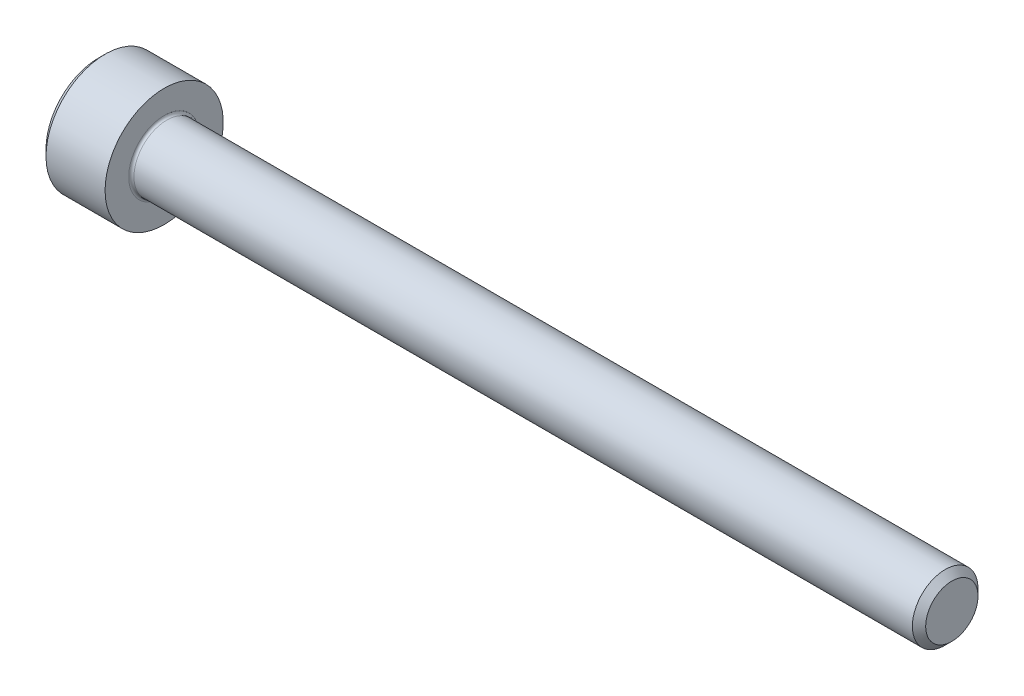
ISO-10303-21;
HEADER;
FILE_DESCRIPTION(('STEP AP214'),'2;1');
FILE_NAME('part.step','',(''),(''),'','','');
FILE_SCHEMA(('AUTOMOTIVE_DESIGN { 1 0 10303 214 1 1 1 1 }'));
ENDSEC;
DATA;
#1=APPLICATION_CONTEXT('core data for automotive mechanical design processes');
#2=APPLICATION_PROTOCOL_DEFINITION('international standard','automotive_design',2000,#1);
#3=PRODUCT_CONTEXT('',#1,'mechanical');
#4=PRODUCT('Part','Part','',(#3));
#5=PRODUCT_RELATED_PRODUCT_CATEGORY('part','',(#4));
#6=PRODUCT_DEFINITION_FORMATION('','',#4);
#7=PRODUCT_DEFINITION_CONTEXT('part definition',#1,'design');
#8=PRODUCT_DEFINITION('design','',#6,#7);
#9=PRODUCT_DEFINITION_SHAPE('','',#8);
#10=(LENGTH_UNIT() NAMED_UNIT(*) SI_UNIT(.MILLI.,.METRE.));
#11=(NAMED_UNIT(*) PLANE_ANGLE_UNIT() SI_UNIT($,.RADIAN.));
#12=(NAMED_UNIT(*) SI_UNIT($,.STERADIAN.) SOLID_ANGLE_UNIT());
#13=UNCERTAINTY_MEASURE_WITH_UNIT(LENGTH_MEASURE(1.E-05),#10,'distance_accuracy_value','');
#14=(GEOMETRIC_REPRESENTATION_CONTEXT(3) GLOBAL_UNCERTAINTY_ASSIGNED_CONTEXT((#13)) GLOBAL_UNIT_ASSIGNED_CONTEXT((#10,
#11,#12)) REPRESENTATION_CONTEXT('',''));
#15=CARTESIAN_POINT('',(0.,0.,0.));
#16=DIRECTION('',(0.,0.,1.));
#17=DIRECTION('',(1.,0.,0.));
#18=AXIS2_PLACEMENT_3D('',#15,#16,#17);
#19=CARTESIAN_POINT('',(0.,0.,0.));
#20=DIRECTION('',(-1.,0.,0.));
#21=DIRECTION('',(0.,0.,1.));
#22=AXIS2_PLACEMENT_3D('',#19,#20,#21);
#23=PLANE('',#22);
#24=DIRECTION('',(0.,-0.499999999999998,0.866025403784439));
#25=VECTOR('',#24,1.);
#26=CARTESIAN_POINT('',(0.,1.18068130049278,0.));
#27=LINE('',#26,#25);
#28=CARTESIAN_POINT('',(0.,1.18068130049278,0.));
#29=VERTEX_POINT('',#28);
#30=CARTESIAN_POINT('',(0.,0.590340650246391,1.0225));
#31=VERTEX_POINT('',#30);
#32=EDGE_CURVE('E370',#29,#31,#27,.T.);
#33=ORIENTED_EDGE('',*,*,#32,.T.);
#34=DIRECTION('',(0.,1.,0.));
#35=VECTOR('',#34,1.);
#36=CARTESIAN_POINT('',(0.,-0.590340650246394,1.0225));
#37=LINE('',#36,#35);
#38=CARTESIAN_POINT('',(0.,-0.590340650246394,1.0225));
#39=VERTEX_POINT('',#38);
#40=EDGE_CURVE('E126',#39,#31,#37,.T.);
#41=ORIENTED_EDGE('',*,*,#40,.F.);
#42=DIRECTION('',(0.,-0.500000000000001,-0.866025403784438));
#43=VECTOR('',#42,1.);
#44=CARTESIAN_POINT('',(0.,-0.590340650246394,1.0225));
#45=LINE('',#44,#43);
#46=CARTESIAN_POINT('',(0.,-1.18068130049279,0.));
#47=VERTEX_POINT('',#46);
#48=EDGE_CURVE('E373',#39,#47,#45,.T.);
#49=ORIENTED_EDGE('',*,*,#48,.T.);
#50=DIRECTION('',(0.,0.499999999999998,-0.86602540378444));
#51=VECTOR('',#50,1.);
#52=CARTESIAN_POINT('',(0.,-1.18068130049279,0.));
#53=LINE('',#52,#51);
#54=CARTESIAN_POINT('',(0.,-0.590340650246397,-1.0225));
#55=VERTEX_POINT('',#54);
#56=EDGE_CURVE('E376',#47,#55,#53,.T.);
#57=ORIENTED_EDGE('',*,*,#56,.T.);
#58=DIRECTION('',(0.,-1.,0.));
#59=VECTOR('',#58,1.);
#60=CARTESIAN_POINT('',(0.,0.590340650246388,-1.0225));
#61=LINE('',#60,#59);
#62=CARTESIAN_POINT('',(0.,0.590340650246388,-1.0225));
#63=VERTEX_POINT('',#62);
#64=EDGE_CURVE('E379',#63,#55,#61,.T.);
#65=ORIENTED_EDGE('',*,*,#64,.F.);
#66=DIRECTION('',(0.,-0.500000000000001,-0.866025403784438));
#67=VECTOR('',#66,1.);
#68=CARTESIAN_POINT('',(0.,1.18068130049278,0.));
#69=LINE('',#68,#67);
#70=EDGE_CURVE('E121',#29,#63,#69,.T.);
#71=ORIENTED_EDGE('',*,*,#70,.F.);
#72=EDGE_LOOP('',(#33,#41,#49,#57,#65,#71));
#73=FACE_BOUND('',#72,.T.);
#74=CARTESIAN_POINT('',(0.,0.,0.));
#75=DIRECTION('',(-1.,0.,0.));
#76=DIRECTION('',(0.,0.,1.));
#77=AXIS2_PLACEMENT_3D('',#74,#75,#76);
#78=CIRCLE('',#77,2.);
#79=CARTESIAN_POINT('',(0.,0.,2.));
#80=VERTEX_POINT('',#79);
#81=EDGE_CURVE('E137',#80,#80,#78,.T.);
#82=ORIENTED_EDGE('',*,*,#81,.T.);
#83=EDGE_LOOP('',(#82));
#84=FACE_BOUND('',#83,.T.);
#85=ADVANCED_FACE('F30',(#73,#84),#23,.T.);
#86=CARTESIAN_POINT('',(32.5,0.9965,0.));
#87=DIRECTION('',(1.,0.,0.));
#88=DIRECTION('',(0.,0.,-1.));
#89=AXIS2_PLACEMENT_3D('',#86,#87,#88);
#90=PLANE('',#89);
#91=CARTESIAN_POINT('',(32.5,0.,0.));
#92=DIRECTION('',(-1.,0.,0.));
#93=DIRECTION('',(0.,0.,1.));
#94=AXIS2_PLACEMENT_3D('',#91,#92,#93);
#95=CIRCLE('',#94,0.9965);
#96=CARTESIAN_POINT('',(32.5,0.,0.9965));
#97=VERTEX_POINT('',#96);
#98=EDGE_CURVE('E150',#97,#97,#95,.T.);
#99=ORIENTED_EDGE('',*,*,#98,.F.);
#100=EDGE_LOOP('',(#99));
#101=FACE_BOUND('',#100,.T.);
#102=ADVANCED_FACE('F171',(#101),#90,.T.);
#103=CARTESIAN_POINT('',(32.5,0.,0.));
#104=DIRECTION('',(-1.,0.,0.));
#105=DIRECTION('',(0.,0.,1.));
#106=AXIS2_PLACEMENT_3D('',#103,#104,#105);
#107=CONICAL_SURFACE('',#106,0.9965,0.785398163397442);
#108=CARTESIAN_POINT('',(32.2465,0.,0.));
#109=DIRECTION('',(-1.,0.,0.));
#110=DIRECTION('',(0.,0.,1.));
#111=AXIS2_PLACEMENT_3D('',#108,#109,#110);
#112=CIRCLE('',#111,1.25);
#113=CARTESIAN_POINT('',(32.2465,0.,1.25));
#114=VERTEX_POINT('',#113);
#115=EDGE_CURVE('E147',#114,#114,#112,.T.);
#116=ORIENTED_EDGE('',*,*,#115,.F.);
#117=EDGE_LOOP('',(#116));
#118=FACE_BOUND('',#117,.T.);
#119=ORIENTED_EDGE('',*,*,#98,.T.);
#120=EDGE_LOOP('',(#119));
#121=FACE_BOUND('',#120,.T.);
#122=ADVANCED_FACE('F177',(#118,#121),#107,.T.);
#123=CARTESIAN_POINT('',(-31.75,0.,0.));
#124=DIRECTION('',(-1.,0.,0.));
#125=DIRECTION('',(0.,0.,1.));
#126=AXIS2_PLACEMENT_3D('',#123,#124,#125);
#127=CYLINDRICAL_SURFACE('',#126,1.25);
#128=CARTESIAN_POINT('',(2.6,0.,0.));
#129=DIRECTION('',(1.,0.,0.));
#130=DIRECTION('',(0.,0.,-1.));
#131=AXIS2_PLACEMENT_3D('',#128,#129,#130);
#132=CIRCLE('',#131,1.25);
#133=CARTESIAN_POINT('',(2.6,0.,-1.25));
#134=VERTEX_POINT('',#133);
#135=EDGE_CURVE('E11',#134,#134,#132,.T.);
#136=ORIENTED_EDGE('',*,*,#135,.T.);
#137=EDGE_LOOP('',(#136));
#138=FACE_BOUND('',#137,.T.);
#139=ORIENTED_EDGE('',*,*,#115,.T.);
#140=EDGE_LOOP('',(#139));
#141=FACE_BOUND('',#140,.T.);
#142=ADVANCED_FACE('F188',(#138,#141),#127,.T.);
#143=CARTESIAN_POINT('',(2.5,2.25,0.));
#144=DIRECTION('',(1.,0.,0.));
#145=DIRECTION('',(0.,0.,-1.));
#146=AXIS2_PLACEMENT_3D('',#143,#144,#145);
#147=PLANE('',#146);
#148=CARTESIAN_POINT('',(2.5,0.,0.));
#149=DIRECTION('',(1.,0.,0.));
#150=DIRECTION('',(0.,0.,-1.));
#151=AXIS2_PLACEMENT_3D('',#148,#149,#150);
#152=CIRCLE('',#151,1.35);
#153=CARTESIAN_POINT('',(2.5,0.,-1.35));
#154=VERTEX_POINT('',#153);
#155=EDGE_CURVE('E38',#154,#154,#152,.F.);
#156=ORIENTED_EDGE('',*,*,#155,.T.);
#157=EDGE_LOOP('',(#156));
#158=FACE_BOUND('',#157,.T.);
#159=CARTESIAN_POINT('',(2.5,0.,0.));
#160=DIRECTION('',(-1.,0.,0.));
#161=DIRECTION('',(0.,0.,1.));
#162=AXIS2_PLACEMENT_3D('',#159,#160,#161);
#163=CIRCLE('',#162,2.25);
#164=CARTESIAN_POINT('',(2.5,0.,2.25));
#165=VERTEX_POINT('',#164);
#166=EDGE_CURVE('E144',#165,#165,#163,.T.);
#167=ORIENTED_EDGE('',*,*,#166,.F.);
#168=EDGE_LOOP('',(#167));
#169=FACE_BOUND('',#168,.T.);
#170=ADVANCED_FACE('F155',(#158,#169),#147,.T.);
#171=CARTESIAN_POINT('',(-31.75,0.,0.));
#172=DIRECTION('',(-1.,0.,0.));
#173=DIRECTION('',(0.,0.,1.));
#174=AXIS2_PLACEMENT_3D('',#171,#172,#173);
#175=CYLINDRICAL_SURFACE('',#174,2.25);
#176=ORIENTED_EDGE('',*,*,#166,.T.);
#177=EDGE_LOOP('',(#176));
#178=FACE_BOUND('',#177,.T.);
#179=CARTESIAN_POINT('',(0.25,0.,0.));
#180=DIRECTION('',(-1.,0.,0.));
#181=DIRECTION('',(0.,0.,1.));
#182=AXIS2_PLACEMENT_3D('',#179,#180,#181);
#183=CIRCLE('',#182,2.25);
#184=CARTESIAN_POINT('',(0.25,0.,2.25));
#185=VERTEX_POINT('',#184);
#186=EDGE_CURVE('E141',#185,#185,#183,.T.);
#187=ORIENTED_EDGE('',*,*,#186,.F.);
#188=EDGE_LOOP('',(#187));
#189=FACE_BOUND('',#188,.T.);
#190=ADVANCED_FACE('F166',(#178,#189),#175,.T.);
#191=CARTESIAN_POINT('',(0.,0.,0.));
#192=DIRECTION('',(1.,0.,0.));
#193=DIRECTION('',(0.,0.,-1.));
#194=AXIS2_PLACEMENT_3D('',#191,#192,#193);
#195=CONICAL_SURFACE('',#194,2.,0.785398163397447);
#196=ORIENTED_EDGE('',*,*,#186,.T.);
#197=EDGE_LOOP('',(#196));
#198=FACE_BOUND('',#197,.T.);
#199=ORIENTED_EDGE('',*,*,#81,.F.);
#200=EDGE_LOOP('',(#199));
#201=FACE_BOUND('',#200,.T.);
#202=ADVANCED_FACE('F159',(#198,#201),#195,.T.);
#203=CARTESIAN_POINT('',(2.6,0.,0.));
#204=DIRECTION('',(1.,0.,0.));
#205=DIRECTION('',(0.,0.,-1.));
#206=AXIS2_PLACEMENT_3D('',#203,#204,#205);
#207=TOROIDAL_SURFACE('',#206,1.35,0.1);
#208=ORIENTED_EDGE('',*,*,#135,.F.);
#209=EDGE_LOOP('',(#208));
#210=FACE_BOUND('',#209,.T.);
#211=ORIENTED_EDGE('',*,*,#155,.F.);
#212=EDGE_LOOP('',(#211));
#213=FACE_BOUND('',#212,.T.);
#214=ADVANCED_FACE('F32',(#210,#213),#207,.F.);
#215=CARTESIAN_POINT('',(1.1,1.18068130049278,0.));
#216=DIRECTION('',(0.,-0.86602540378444,-0.499999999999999));
#217=DIRECTION('',(0.,0.499999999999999,-0.86602540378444));
#218=AXIS2_PLACEMENT_3D('',#215,#216,#217);
#219=PLANE('',#218);
#220=ORIENTED_EDGE('',*,*,#32,.F.);
#221=DIRECTION('',(-1.,0.,0.));
#222=VECTOR('',#221,1.);
#223=CARTESIAN_POINT('',(1.1,1.18068130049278,0.));
#224=LINE('',#223,#222);
#225=CARTESIAN_POINT('',(1.1,1.18068130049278,0.));
#226=VERTEX_POINT('',#225);
#227=EDGE_CURVE('E360',#226,#29,#224,.T.);
#228=ORIENTED_EDGE('',*,*,#227,.F.);
#229=DIRECTION('',(0.,-0.499999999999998,0.866025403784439));
#230=VECTOR('',#229,1.);
#231=CARTESIAN_POINT('',(1.1,1.18068130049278,0.));
#232=LINE('',#231,#230);
#233=CARTESIAN_POINT('',(1.1,0.885510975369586,0.511249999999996));
#234=VERTEX_POINT('',#233);
#235=EDGE_CURVE('E113',#226,#234,#232,.T.);
#236=ORIENTED_EDGE('',*,*,#235,.T.);
#237=CARTESIAN_POINT('',(1.1,0.590340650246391,1.0225));
#238=VERTEX_POINT('',#237);
#239=EDGE_CURVE('E104',#234,#238,#232,.T.);
#240=ORIENTED_EDGE('',*,*,#239,.T.);
#241=DIRECTION('',(-1.,0.,0.));
#242=VECTOR('',#241,1.);
#243=CARTESIAN_POINT('',(1.1,0.590340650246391,1.0225));
#244=LINE('',#243,#242);
#245=EDGE_CURVE('E118',#238,#31,#244,.T.);
#246=ORIENTED_EDGE('',*,*,#245,.T.);
#247=EDGE_LOOP('',(#220,#228,#236,#240,#246));
#248=FACE_BOUND('',#247,.T.);
#249=ADVANCED_FACE('F117',(#248),#219,.T.);
#250=CARTESIAN_POINT('',(1.1,-0.590340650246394,1.0225));
#251=DIRECTION('',(0.,0.,1.));
#252=DIRECTION('',(0.,-1.,0.));
#253=AXIS2_PLACEMENT_3D('',#250,#251,#252);
#254=PLANE('',#253);
#255=ORIENTED_EDGE('',*,*,#40,.T.);
#256=ORIENTED_EDGE('',*,*,#245,.F.);
#257=DIRECTION('',(0.,1.,0.));
#258=VECTOR('',#257,1.);
#259=CARTESIAN_POINT('',(1.1,-0.590340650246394,1.0225));
#260=LINE('',#259,#258);
#261=CARTESIAN_POINT('',(1.1,0.,1.0225));
#262=VERTEX_POINT('',#261);
#263=EDGE_CURVE('E101',#262,#238,#260,.T.);
#264=ORIENTED_EDGE('',*,*,#263,.F.);
#265=CARTESIAN_POINT('',(1.1,-0.590340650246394,1.0225));
#266=VERTEX_POINT('',#265);
#267=EDGE_CURVE('E112',#266,#262,#260,.T.);
#268=ORIENTED_EDGE('',*,*,#267,.F.);
#269=DIRECTION('',(-1.,0.,0.));
#270=VECTOR('',#269,1.);
#271=CARTESIAN_POINT('',(1.1,-0.590340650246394,1.0225));
#272=LINE('',#271,#270);
#273=EDGE_CURVE('E128',#266,#39,#272,.T.);
#274=ORIENTED_EDGE('',*,*,#273,.T.);
#275=EDGE_LOOP('',(#255,#256,#264,#268,#274));
#276=FACE_BOUND('',#275,.T.);
#277=ADVANCED_FACE('F123',(#276),#254,.F.);
#278=CARTESIAN_POINT('',(1.1,-0.590340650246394,1.0225));
#279=DIRECTION('',(0.,0.866025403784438,-0.500000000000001));
#280=DIRECTION('',(0.,0.500000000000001,0.866025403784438));
#281=AXIS2_PLACEMENT_3D('',#278,#279,#280);
#282=PLANE('',#281);
#283=ORIENTED_EDGE('',*,*,#48,.F.);
#284=ORIENTED_EDGE('',*,*,#273,.F.);
#285=DIRECTION('',(0.,-0.500000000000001,-0.866025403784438));
#286=VECTOR('',#285,1.);
#287=CARTESIAN_POINT('',(1.1,-0.590340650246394,1.0225));
#288=LINE('',#287,#286);
#289=CARTESIAN_POINT('',(1.1,-0.885510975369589,0.511250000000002));
#290=VERTEX_POINT('',#289);
#291=EDGE_CURVE('E399',#266,#290,#288,.T.);
#292=ORIENTED_EDGE('',*,*,#291,.T.);
#293=CARTESIAN_POINT('',(1.1,-1.18068130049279,0.));
#294=VERTEX_POINT('',#293);
#295=EDGE_CURVE('E388',#290,#294,#288,.T.);
#296=ORIENTED_EDGE('',*,*,#295,.T.);
#297=DIRECTION('',(-1.,0.,0.));
#298=VECTOR('',#297,1.);
#299=CARTESIAN_POINT('',(1.1,-1.18068130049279,0.));
#300=LINE('',#299,#298);
#301=EDGE_CURVE('E133',#294,#47,#300,.T.);
#302=ORIENTED_EDGE('',*,*,#301,.T.);
#303=EDGE_LOOP('',(#283,#284,#292,#296,#302));
#304=FACE_BOUND('',#303,.T.);
#305=ADVANCED_FACE('F251',(#304),#282,.T.);
#306=CARTESIAN_POINT('',(1.1,-1.18068130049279,0.));
#307=DIRECTION('',(0.,0.86602540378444,0.499999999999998));
#308=DIRECTION('',(0.,-0.499999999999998,0.86602540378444));
#309=AXIS2_PLACEMENT_3D('',#306,#307,#308);
#310=PLANE('',#309);
#311=ORIENTED_EDGE('',*,*,#56,.F.);
#312=ORIENTED_EDGE('',*,*,#301,.F.);
#313=DIRECTION('',(0.,0.499999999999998,-0.86602540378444));
#314=VECTOR('',#313,1.);
#315=CARTESIAN_POINT('',(1.1,-1.18068130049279,0.));
#316=LINE('',#315,#314);
#317=CARTESIAN_POINT('',(1.1,-0.885510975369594,-0.51125));
#318=VERTEX_POINT('',#317);
#319=EDGE_CURVE('E366',#294,#318,#316,.T.);
#320=ORIENTED_EDGE('',*,*,#319,.T.);
#321=CARTESIAN_POINT('',(1.1,-0.590340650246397,-1.0225));
#322=VERTEX_POINT('',#321);
#323=EDGE_CURVE('E398',#318,#322,#316,.T.);
#324=ORIENTED_EDGE('',*,*,#323,.T.);
#325=DIRECTION('',(-1.,0.,0.));
#326=VECTOR('',#325,1.);
#327=CARTESIAN_POINT('',(1.1,-0.590340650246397,-1.0225));
#328=LINE('',#327,#326);
#329=EDGE_CURVE('E359',#322,#55,#328,.T.);
#330=ORIENTED_EDGE('',*,*,#329,.T.);
#331=EDGE_LOOP('',(#311,#312,#320,#324,#330));
#332=FACE_BOUND('',#331,.T.);
#333=ADVANCED_FACE('F259',(#332),#310,.T.);
#334=CARTESIAN_POINT('',(1.1,0.590340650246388,-1.0225));
#335=DIRECTION('',(0.,0.,-1.));
#336=DIRECTION('',(0.,1.,0.));
#337=AXIS2_PLACEMENT_3D('',#334,#335,#336);
#338=PLANE('',#337);
#339=ORIENTED_EDGE('',*,*,#64,.T.);
#340=ORIENTED_EDGE('',*,*,#329,.F.);
#341=DIRECTION('',(0.,-1.,0.));
#342=VECTOR('',#341,1.);
#343=CARTESIAN_POINT('',(1.1,0.590340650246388,-1.0225));
#344=LINE('',#343,#342);
#345=CARTESIAN_POINT('',(1.1,0.,-1.0225));
#346=VERTEX_POINT('',#345);
#347=EDGE_CURVE('E363',#346,#322,#344,.T.);
#348=ORIENTED_EDGE('',*,*,#347,.F.);
#349=CARTESIAN_POINT('',(1.1,0.590340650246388,-1.0225));
#350=VERTEX_POINT('',#349);
#351=EDGE_CURVE('E45',#350,#346,#344,.T.);
#352=ORIENTED_EDGE('',*,*,#351,.F.);
#353=DIRECTION('',(-1.,0.,0.));
#354=VECTOR('',#353,1.);
#355=CARTESIAN_POINT('',(1.1,0.590340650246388,-1.0225));
#356=LINE('',#355,#354);
#357=EDGE_CURVE('E356',#350,#63,#356,.T.);
#358=ORIENTED_EDGE('',*,*,#357,.T.);
#359=EDGE_LOOP('',(#339,#340,#348,#352,#358));
#360=FACE_BOUND('',#359,.T.);
#361=ADVANCED_FACE('F268',(#360),#338,.F.);
#362=CARTESIAN_POINT('',(1.1,1.18068130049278,0.));
#363=DIRECTION('',(0.,0.866025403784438,-0.500000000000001));
#364=DIRECTION('',(0.,0.500000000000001,0.866025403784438));
#365=AXIS2_PLACEMENT_3D('',#362,#363,#364);
#366=PLANE('',#365);
#367=ORIENTED_EDGE('',*,*,#70,.T.);
#368=ORIENTED_EDGE('',*,*,#357,.F.);
#369=DIRECTION('',(0.,-0.500000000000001,-0.866025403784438));
#370=VECTOR('',#369,1.);
#371=CARTESIAN_POINT('',(1.1,1.18068130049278,0.));
#372=LINE('',#371,#370);
#373=CARTESIAN_POINT('',(1.1,0.885510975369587,-0.511250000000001));
#374=VERTEX_POINT('',#373);
#375=EDGE_CURVE('E346',#374,#350,#372,.T.);
#376=ORIENTED_EDGE('',*,*,#375,.F.);
#377=EDGE_CURVE('E352',#226,#374,#372,.T.);
#378=ORIENTED_EDGE('',*,*,#377,.F.);
#379=ORIENTED_EDGE('',*,*,#227,.T.);
#380=EDGE_LOOP('',(#367,#368,#376,#378,#379));
#381=FACE_BOUND('',#380,.T.);
#382=ADVANCED_FACE('F277',(#381),#366,.F.);
#383=CARTESIAN_POINT('',(1.1,1.77102195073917,-1.0225));
#384=DIRECTION('',(1.,0.,0.));
#385=DIRECTION('',(0.,0.,-1.));
#386=AXIS2_PLACEMENT_3D('',#383,#384,#385);
#387=PLANE('',#386);
#388=ORIENTED_EDGE('',*,*,#347,.T.);
#389=ORIENTED_EDGE('',*,*,#323,.F.);
#390=CARTESIAN_POINT('',(1.1,0.,0.));
#391=DIRECTION('',(-1.,0.,0.));
#392=DIRECTION('',(0.,0.,1.));
#393=AXIS2_PLACEMENT_3D('',#390,#391,#392);
#394=CIRCLE('',#393,1.0225);
#395=EDGE_CURVE('E394',#346,#318,#394,.T.);
#396=ORIENTED_EDGE('',*,*,#395,.F.);
#397=EDGE_LOOP('',(#388,#389,#396));
#398=FACE_BOUND('',#397,.T.);
#399=ADVANCED_FACE('F286',(#398),#387,.F.);
#400=ORIENTED_EDGE('',*,*,#319,.F.);
#401=ORIENTED_EDGE('',*,*,#295,.F.);
#402=EDGE_CURVE('E131',#318,#290,#394,.T.);
#403=ORIENTED_EDGE('',*,*,#402,.F.);
#404=EDGE_LOOP('',(#400,#401,#403));
#405=FACE_BOUND('',#404,.T.);
#406=ADVANCED_FACE('F295',(#405),#387,.F.);
#407=ORIENTED_EDGE('',*,*,#291,.F.);
#408=ORIENTED_EDGE('',*,*,#267,.T.);
#409=EDGE_CURVE('E127',#290,#262,#394,.T.);
#410=ORIENTED_EDGE('',*,*,#409,.F.);
#411=EDGE_LOOP('',(#407,#408,#410));
#412=FACE_BOUND('',#411,.T.);
#413=ADVANCED_FACE('F304',(#412),#387,.F.);
#414=ORIENTED_EDGE('',*,*,#263,.T.);
#415=ORIENTED_EDGE('',*,*,#239,.F.);
#416=EDGE_CURVE('E107',#262,#234,#394,.T.);
#417=ORIENTED_EDGE('',*,*,#416,.F.);
#418=EDGE_LOOP('',(#414,#415,#417));
#419=FACE_BOUND('',#418,.T.);
#420=ADVANCED_FACE('F103',(#419),#387,.F.);
#421=ORIENTED_EDGE('',*,*,#235,.F.);
#422=ORIENTED_EDGE('',*,*,#377,.T.);
#423=EDGE_CURVE('E138',#234,#374,#394,.T.);
#424=ORIENTED_EDGE('',*,*,#423,.F.);
#425=EDGE_LOOP('',(#421,#422,#424));
#426=FACE_BOUND('',#425,.T.);
#427=ADVANCED_FACE('F319',(#426),#387,.F.);
#428=ORIENTED_EDGE('',*,*,#375,.T.);
#429=ORIENTED_EDGE('',*,*,#351,.T.);
#430=EDGE_CURVE('E349',#374,#346,#394,.T.);
#431=ORIENTED_EDGE('',*,*,#430,.F.);
#432=EDGE_LOOP('',(#428,#429,#431));
#433=FACE_BOUND('',#432,.T.);
#434=ADVANCED_FACE('F234',(#433),#387,.F.);
#435=CARTESIAN_POINT('',(1.1,0.,0.));
#436=DIRECTION('',(-1.,0.,0.));
#437=DIRECTION('',(0.,0.,1.));
#438=AXIS2_PLACEMENT_3D('',#435,#436,#437);
#439=CONICAL_SURFACE('',#438,1.0225,1.04719755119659);
#440=CARTESIAN_POINT('',(1.6903406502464,0.,0.));
#441=VERTEX_POINT('',#440);
#442=VERTEX_LOOP('',#441);
#443=FACE_BOUND('',#442,.T.);
#444=ORIENTED_EDGE('',*,*,#416,.T.);
#445=ORIENTED_EDGE('',*,*,#423,.T.);
#446=ORIENTED_EDGE('',*,*,#430,.T.);
#447=ORIENTED_EDGE('',*,*,#395,.T.);
#448=ORIENTED_EDGE('',*,*,#402,.T.);
#449=ORIENTED_EDGE('',*,*,#409,.T.);
#450=EDGE_LOOP('',(#444,#445,#446,#447,#448,#449));
#451=FACE_BOUND('',#450,.T.);
#452=ADVANCED_FACE('F181',(#443,#451),#439,.F.);
#453=CLOSED_SHELL('',(#85,#102,#122,#142,#170,#190,#202,#214,#249,#277,#305,#333,#361,#382,#399,
#406,#413,#420,#427,#434,#452));
#454=MANIFOLD_SOLID_BREP('B2',#453);
#455=ADVANCED_BREP_SHAPE_REPRESENTATION('',(#18,#454),#14);
#456=SHAPE_DEFINITION_REPRESENTATION(#9,#455);
ENDSEC;
END-ISO-10303-21;
